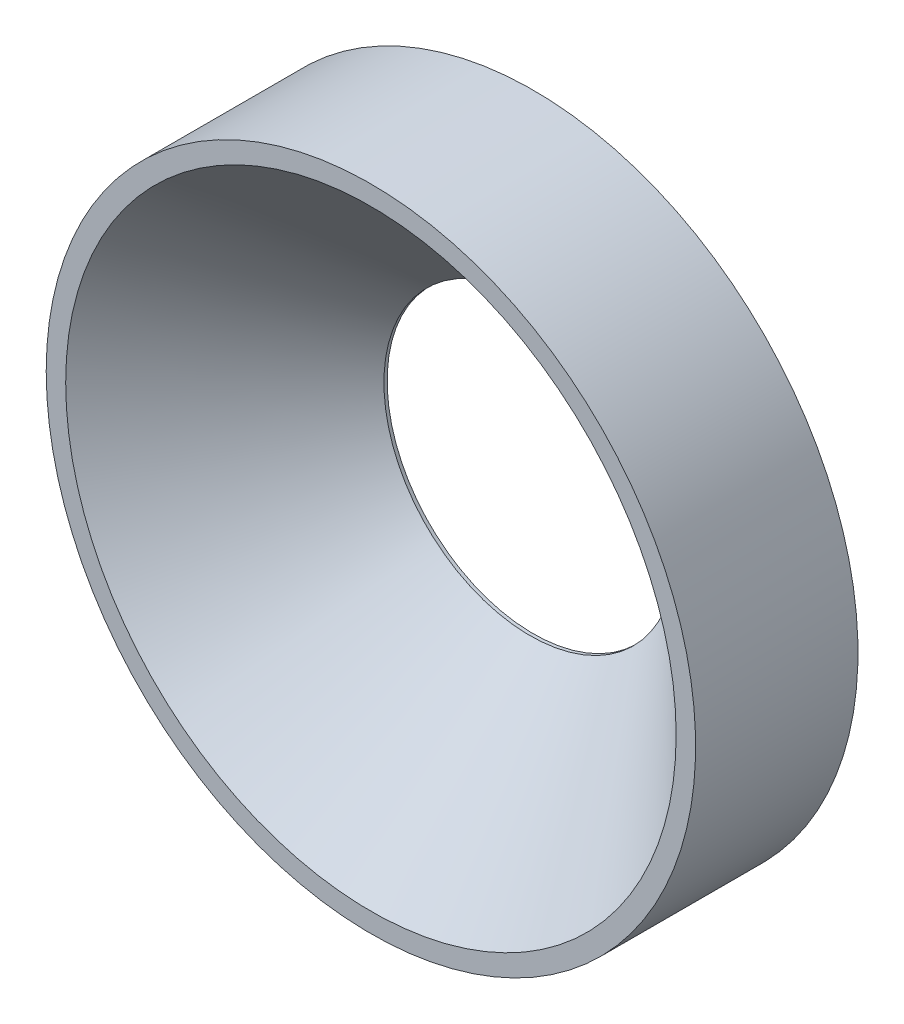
ISO-10303-21;
HEADER;
FILE_DESCRIPTION(('STEP AP214'),'2;1');
FILE_NAME('part.step','',(''),(''),'','','');
FILE_SCHEMA(('AUTOMOTIVE_DESIGN { 1 0 10303 214 1 1 1 1 }'));
ENDSEC;
DATA;
#1=APPLICATION_CONTEXT('core data for automotive mechanical design processes');
#2=APPLICATION_PROTOCOL_DEFINITION('international standard','automotive_design',2000,#1);
#3=PRODUCT_CONTEXT('',#1,'mechanical');
#4=PRODUCT('Part','Part','',(#3));
#5=PRODUCT_RELATED_PRODUCT_CATEGORY('part','',(#4));
#6=PRODUCT_DEFINITION_FORMATION('','',#4);
#7=PRODUCT_DEFINITION_CONTEXT('part definition',#1,'design');
#8=PRODUCT_DEFINITION('design','',#6,#7);
#9=PRODUCT_DEFINITION_SHAPE('','',#8);
#10=(LENGTH_UNIT() NAMED_UNIT(*) SI_UNIT(.MILLI.,.METRE.));
#11=(NAMED_UNIT(*) PLANE_ANGLE_UNIT() SI_UNIT($,.RADIAN.));
#12=(NAMED_UNIT(*) SI_UNIT($,.STERADIAN.) SOLID_ANGLE_UNIT());
#13=UNCERTAINTY_MEASURE_WITH_UNIT(LENGTH_MEASURE(1.E-05),#10,'distance_accuracy_value','');
#14=(GEOMETRIC_REPRESENTATION_CONTEXT(3) GLOBAL_UNCERTAINTY_ASSIGNED_CONTEXT((#13)) GLOBAL_UNIT_ASSIGNED_CONTEXT((#10,
#11,#12)) REPRESENTATION_CONTEXT('',''));
#15=CARTESIAN_POINT('',(0.,0.,0.));
#16=DIRECTION('',(0.,0.,1.));
#17=DIRECTION('',(1.,0.,0.));
#18=AXIS2_PLACEMENT_3D('',#15,#16,#17);
#19=CARTESIAN_POINT('',(0.,0.,2.5));
#20=DIRECTION('',(0.,0.,-1.));
#21=DIRECTION('',(-1.,0.,0.));
#22=AXIS2_PLACEMENT_3D('',#19,#20,#21);
#23=CYLINDRICAL_SURFACE('',#22,5.);
#24=CARTESIAN_POINT('',(0.,0.,2.5));
#25=DIRECTION('',(0.,0.,1.));
#26=DIRECTION('',(1.,0.,0.));
#27=AXIS2_PLACEMENT_3D('',#24,#25,#26);
#28=CIRCLE('',#27,5.);
#29=CARTESIAN_POINT('',(-5.00000000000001,0.,2.5));
#30=VERTEX_POINT('',#29);
#31=EDGE_CURVE('E10',#30,#30,#28,.T.);
#32=CARTESIAN_POINT('',(0.,0.,0.));
#33=DIRECTION('',(0.,0.,1.));
#34=DIRECTION('',(1.,0.,0.));
#35=AXIS2_PLACEMENT_3D('',#32,#33,#34);
#36=CIRCLE('',#35,5.);
#37=CARTESIAN_POINT('',(-5.00000000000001,0.,0.));
#38=VERTEX_POINT('',#37);
#39=EDGE_CURVE('E35',#38,#38,#36,.T.);
#40=CARTESIAN_POINT('',(-5.00000000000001,0.,2.5));
#41=CARTESIAN_POINT('',(-5.00000000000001,0.,2.47395833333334));
#42=CARTESIAN_POINT('',(-5.00000000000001,0.,2.44791666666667));
#43=CARTESIAN_POINT('',(-5.00000000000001,0.,2.39583333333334));
#44=CARTESIAN_POINT('',(-5.00000000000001,0.,2.36979166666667));
#45=CARTESIAN_POINT('',(-5.00000000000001,0.,2.31770833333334));
#46=CARTESIAN_POINT('',(-5.00000000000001,0.,2.29166666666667));
#47=CARTESIAN_POINT('',(-5.00000000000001,0.,2.23958333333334));
#48=CARTESIAN_POINT('',(-5.00000000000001,0.,2.21354166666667));
#49=CARTESIAN_POINT('',(-5.00000000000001,0.,2.16145833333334));
#50=CARTESIAN_POINT('',(-5.00000000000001,0.,2.13541666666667));
#51=CARTESIAN_POINT('',(-5.00000000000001,0.,2.08333333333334));
#52=CARTESIAN_POINT('',(-5.00000000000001,0.,2.05729166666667));
#53=CARTESIAN_POINT('',(-5.00000000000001,0.,2.00520833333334));
#54=CARTESIAN_POINT('',(-5.00000000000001,0.,1.97916666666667));
#55=CARTESIAN_POINT('',(-5.00000000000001,0.,1.92708333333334));
#56=CARTESIAN_POINT('',(-5.00000000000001,0.,1.90104166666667));
#57=CARTESIAN_POINT('',(-5.00000000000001,0.,1.84895833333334));
#58=CARTESIAN_POINT('',(-5.00000000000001,0.,1.82291666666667));
#59=CARTESIAN_POINT('',(-5.00000000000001,0.,1.77083333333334));
#60=CARTESIAN_POINT('',(-5.00000000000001,0.,1.74479166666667));
#61=CARTESIAN_POINT('',(-5.00000000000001,0.,1.69270833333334));
#62=CARTESIAN_POINT('',(-5.00000000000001,0.,1.66666666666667));
#63=CARTESIAN_POINT('',(-5.00000000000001,0.,1.61458333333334));
#64=CARTESIAN_POINT('',(-5.00000000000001,0.,1.58854166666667));
#65=CARTESIAN_POINT('',(-5.00000000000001,0.,1.53645833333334));
#66=CARTESIAN_POINT('',(-5.00000000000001,0.,1.51041666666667));
#67=CARTESIAN_POINT('',(-5.00000000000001,0.,1.45833333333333));
#68=CARTESIAN_POINT('',(-5.00000000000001,0.,1.43229166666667));
#69=CARTESIAN_POINT('',(-5.00000000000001,0.,1.38020833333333));
#70=CARTESIAN_POINT('',(-5.00000000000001,0.,1.35416666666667));
#71=CARTESIAN_POINT('',(-5.00000000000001,0.,1.30208333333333));
#72=CARTESIAN_POINT('',(-5.00000000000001,0.,1.27604166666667));
#73=CARTESIAN_POINT('',(-5.00000000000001,0.,1.22395833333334));
#74=CARTESIAN_POINT('',(-5.00000000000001,0.,1.19791666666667));
#75=CARTESIAN_POINT('',(-5.00000000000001,0.,1.14583333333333));
#76=CARTESIAN_POINT('',(-5.00000000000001,0.,1.11979166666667));
#77=CARTESIAN_POINT('',(-5.00000000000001,0.,1.06770833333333));
#78=CARTESIAN_POINT('',(-5.00000000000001,0.,1.04166666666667));
#79=CARTESIAN_POINT('',(-5.00000000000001,0.,0.989583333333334));
#80=CARTESIAN_POINT('',(-5.00000000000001,0.,0.963541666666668));
#81=CARTESIAN_POINT('',(-5.00000000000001,0.,0.911458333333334));
#82=CARTESIAN_POINT('',(-5.00000000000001,0.,0.885416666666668));
#83=CARTESIAN_POINT('',(-5.00000000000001,0.,0.833333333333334));
#84=CARTESIAN_POINT('',(-5.00000000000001,0.,0.807291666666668));
#85=CARTESIAN_POINT('',(-5.00000000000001,0.,0.755208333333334));
#86=CARTESIAN_POINT('',(-5.00000000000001,0.,0.729166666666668));
#87=CARTESIAN_POINT('',(-5.00000000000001,0.,0.677083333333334));
#88=CARTESIAN_POINT('',(-5.00000000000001,0.,0.651041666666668));
#89=CARTESIAN_POINT('',(-5.00000000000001,0.,0.598958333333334));
#90=CARTESIAN_POINT('',(-5.00000000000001,0.,0.572916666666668));
#91=CARTESIAN_POINT('',(-5.00000000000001,0.,0.520833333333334));
#92=CARTESIAN_POINT('',(-5.00000000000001,0.,0.494791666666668));
#93=CARTESIAN_POINT('',(-5.00000000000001,0.,0.442708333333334));
#94=CARTESIAN_POINT('',(-5.00000000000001,0.,0.416666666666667));
#95=CARTESIAN_POINT('',(-5.00000000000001,0.,0.364583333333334));
#96=CARTESIAN_POINT('',(-5.00000000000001,0.,0.338541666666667));
#97=CARTESIAN_POINT('',(-5.00000000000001,0.,0.286458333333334));
#98=CARTESIAN_POINT('',(-5.00000000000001,0.,0.260416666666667));
#99=CARTESIAN_POINT('',(-5.00000000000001,0.,0.208333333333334));
#100=CARTESIAN_POINT('',(-5.00000000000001,0.,0.182291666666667));
#101=CARTESIAN_POINT('',(-5.00000000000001,0.,0.130208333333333));
#102=CARTESIAN_POINT('',(-5.00000000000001,0.,0.104166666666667));
#103=CARTESIAN_POINT('',(-5.00000000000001,0.,0.0520833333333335));
#104=CARTESIAN_POINT('',(-5.00000000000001,0.,0.026041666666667));
#105=CARTESIAN_POINT('',(-5.00000000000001,0.,0.));
#106=B_SPLINE_CURVE_WITH_KNOTS('',3,(#40,#41,#42,#43,#44,#45,#46,#47,#48,#49,#50,#51,#52,#53,
#54,#55,#56,#57,#58,#59,#60,#61,#62,#63,#64,#65,#66,#67,#68,#69,#70,#71,#72,#73,#74,#75,#76,#77,
#78,#79,#80,#81,#82,#83,#84,#85,#86,#87,#88,#89,#90,#91,#92,#93,#94,#95,#96,#97,#98,#99,#100,
#101,#102,#103,#104,#105),.UNSPECIFIED.,.F.,.F.,(4,2,2,2,2,2,2,2,2,2,2,2,2,2,2,2,2,2,2,2,2,2,2,
2,2,2,2,2,2,2,2,2,4),(0.,0.0781250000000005,0.156250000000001,0.234375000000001,
0.312500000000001,0.390625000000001,0.468750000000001,0.546875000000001,0.625000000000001,
0.703125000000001,0.781250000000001,0.859375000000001,0.937500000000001,1.015625,1.09375,
1.171875,1.25,1.328125,1.40625,1.484375,1.5625,1.640625,1.71875,1.796875,1.875,1.953125,2.03125,
2.109375,2.1875,2.265625,2.34375,2.421875,2.5),.UNSPECIFIED.);
#107=EDGE_CURVE('BSEAM28',#30,#38,#106,.T.);
#108=ORIENTED_EDGE('',*,*,#31,.F.);
#109=ORIENTED_EDGE('',*,*,#39,.T.);
#110=ORIENTED_EDGE('',*,*,#107,.T.);
#111=ORIENTED_EDGE('',*,*,#107,.F.);
#112=EDGE_LOOP('',(#108,#110,#109,#111));
#113=FACE_BOUND('',#112,.T.);
#114=ADVANCED_FACE('F28',(#113),#23,.T.);
#115=CARTESIAN_POINT('',(0.,0.,2.5));
#116=DIRECTION('',(0.,0.,1.));
#117=DIRECTION('',(1.,0.,0.));
#118=AXIS2_PLACEMENT_3D('',#115,#116,#117);
#119=PLANE('',#118);
#120=CARTESIAN_POINT('',(0.,0.,2.5));
#121=DIRECTION('',(0.,0.,1.));
#122=DIRECTION('',(1.,0.,0.));
#123=AXIS2_PLACEMENT_3D('',#120,#121,#122);
#124=CIRCLE('',#123,4.7);
#125=CARTESIAN_POINT('',(4.70000000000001,0.,2.5));
#126=VERTEX_POINT('',#125);
#127=EDGE_CURVE('E41',#126,#126,#124,.T.);
#128=ORIENTED_EDGE('',*,*,#127,.F.);
#129=EDGE_LOOP('',(#128));
#130=FACE_BOUND('',#129,.T.);
#131=ORIENTED_EDGE('',*,*,#31,.T.);
#132=EDGE_LOOP('',(#131));
#133=FACE_BOUND('',#132,.T.);
#134=ADVANCED_FACE('F57',(#130,#133),#119,.T.);
#135=CARTESIAN_POINT('',(0.,0.,0.));
#136=DIRECTION('',(0.,0.,1.));
#137=DIRECTION('',(1.,0.,0.));
#138=AXIS2_PLACEMENT_3D('',#135,#136,#137);
#139=PLANE('',#138);
#140=CARTESIAN_POINT('',(0.,0.,0.));
#141=DIRECTION('',(0.,0.,1.));
#142=DIRECTION('',(1.,0.,0.));
#143=AXIS2_PLACEMENT_3D('',#140,#141,#142);
#144=CIRCLE('',#143,2.25);
#145=CARTESIAN_POINT('',(2.25000000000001,0.,0.));
#146=VERTEX_POINT('',#145);
#147=EDGE_CURVE('E31',#146,#146,#144,.T.);
#148=ORIENTED_EDGE('',*,*,#147,.T.);
#149=EDGE_LOOP('',(#148));
#150=FACE_BOUND('',#149,.T.);
#151=ORIENTED_EDGE('',*,*,#39,.F.);
#152=EDGE_LOOP('',(#151));
#153=FACE_BOUND('',#152,.T.);
#154=ADVANCED_FACE('F59',(#150,#153),#139,.F.);
#155=CARTESIAN_POINT('',(0.,0.,2.5));
#156=DIRECTION('',(0.,0.,1.));
#157=DIRECTION('',(1.,0.,0.));
#158=AXIS2_PLACEMENT_3D('',#155,#156,#157);
#159=CYLINDRICAL_SURFACE('',#158,2.25);
#160=CARTESIAN_POINT('',(0.,0.,0.0499999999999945));
#161=DIRECTION('',(0.,0.,1.));
#162=DIRECTION('',(1.,0.,0.));
#163=AXIS2_PLACEMENT_3D('',#160,#161,#162);
#164=CIRCLE('',#163,2.25);
#165=CARTESIAN_POINT('',(2.25000000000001,0.,0.0499999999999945));
#166=VERTEX_POINT('',#165);
#167=EDGE_CURVE('E44',#166,#166,#164,.T.);
#168=CARTESIAN_POINT('',(2.25000000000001,0.,0.0499999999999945));
#169=CARTESIAN_POINT('',(2.25000000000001,0.,0.0494791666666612));
#170=CARTESIAN_POINT('',(2.25000000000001,0.,0.0489583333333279));
#171=CARTESIAN_POINT('',(2.25000000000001,0.,0.0479166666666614));
#172=CARTESIAN_POINT('',(2.25000000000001,0.,0.0473958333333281));
#173=CARTESIAN_POINT('',(2.25000000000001,0.,0.0463541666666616));
#174=CARTESIAN_POINT('',(2.25000000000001,0.,0.0458333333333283));
#175=CARTESIAN_POINT('',(2.25000000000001,0.,0.0447916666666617));
#176=CARTESIAN_POINT('',(2.25000000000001,0.,0.0442708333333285));
#177=CARTESIAN_POINT('',(2.25000000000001,0.,0.0432291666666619));
#178=CARTESIAN_POINT('',(2.25000000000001,0.,0.0427083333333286));
#179=CARTESIAN_POINT('',(2.25000000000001,0.,0.0416666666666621));
#180=CARTESIAN_POINT('',(2.25000000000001,0.,0.0411458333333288));
#181=CARTESIAN_POINT('',(2.25000000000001,0.,0.0401041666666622));
#182=CARTESIAN_POINT('',(2.25000000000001,0.,0.039583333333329));
#183=CARTESIAN_POINT('',(2.25000000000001,0.,0.0385416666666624));
#184=CARTESIAN_POINT('',(2.25000000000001,0.,0.0380208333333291));
#185=CARTESIAN_POINT('',(2.25000000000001,0.,0.0369791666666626));
#186=CARTESIAN_POINT('',(2.25000000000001,0.,0.0364583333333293));
#187=CARTESIAN_POINT('',(2.25000000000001,0.,0.0354166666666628));
#188=CARTESIAN_POINT('',(2.25000000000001,0.,0.0348958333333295));
#189=CARTESIAN_POINT('',(2.25000000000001,0.,0.0338541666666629));
#190=CARTESIAN_POINT('',(2.25000000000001,0.,0.0333333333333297));
#191=CARTESIAN_POINT('',(2.25000000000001,0.,0.0322916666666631));
#192=CARTESIAN_POINT('',(2.25000000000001,0.,0.0317708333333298));
#193=CARTESIAN_POINT('',(2.25000000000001,0.,0.0307291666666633));
#194=CARTESIAN_POINT('',(2.25000000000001,0.,0.03020833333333));
#195=CARTESIAN_POINT('',(2.25000000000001,0.,0.0291666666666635));
#196=CARTESIAN_POINT('',(2.25000000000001,0.,0.0286458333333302));
#197=CARTESIAN_POINT('',(2.25000000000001,0.,0.0276041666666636));
#198=CARTESIAN_POINT('',(2.25000000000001,0.,0.0270833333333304));
#199=CARTESIAN_POINT('',(2.25000000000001,0.,0.0260416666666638));
#200=CARTESIAN_POINT('',(2.25000000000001,0.,0.0255208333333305));
#201=CARTESIAN_POINT('',(2.25000000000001,0.,0.024479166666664));
#202=CARTESIAN_POINT('',(2.25000000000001,0.,0.0239583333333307));
#203=CARTESIAN_POINT('',(2.25000000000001,0.,0.0229166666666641));
#204=CARTESIAN_POINT('',(2.25000000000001,0.,0.0223958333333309));
#205=CARTESIAN_POINT('',(2.25000000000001,0.,0.0213541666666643));
#206=CARTESIAN_POINT('',(2.25000000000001,0.,0.020833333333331));
#207=CARTESIAN_POINT('',(2.25000000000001,0.,0.0197916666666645));
#208=CARTESIAN_POINT('',(2.25000000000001,0.,0.0192708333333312));
#209=CARTESIAN_POINT('',(2.25000000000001,0.,0.0182291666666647));
#210=CARTESIAN_POINT('',(2.25000000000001,0.,0.0177083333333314));
#211=CARTESIAN_POINT('',(2.25000000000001,0.,0.0166666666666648));
#212=CARTESIAN_POINT('',(2.25000000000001,0.,0.0161458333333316));
#213=CARTESIAN_POINT('',(2.25000000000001,0.,0.015104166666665));
#214=CARTESIAN_POINT('',(2.25000000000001,0.,0.0145833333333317));
#215=CARTESIAN_POINT('',(2.25000000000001,0.,0.0135416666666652));
#216=CARTESIAN_POINT('',(2.25000000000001,0.,0.0130208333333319));
#217=CARTESIAN_POINT('',(2.25000000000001,0.,0.0119791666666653));
#218=CARTESIAN_POINT('',(2.25000000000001,0.,0.0114583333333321));
#219=CARTESIAN_POINT('',(2.25000000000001,0.,0.0104166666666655));
#220=CARTESIAN_POINT('',(2.25000000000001,0.,0.00989583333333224));
#221=CARTESIAN_POINT('',(2.25000000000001,0.,0.00885416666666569));
#222=CARTESIAN_POINT('',(2.25000000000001,0.,0.00833333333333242));
#223=CARTESIAN_POINT('',(2.25000000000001,0.,0.00729166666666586));
#224=CARTESIAN_POINT('',(2.25000000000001,0.,0.00677083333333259));
#225=CARTESIAN_POINT('',(2.25000000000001,0.,0.00572916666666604));
#226=CARTESIAN_POINT('',(2.25000000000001,0.,0.00520833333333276));
#227=CARTESIAN_POINT('',(2.25000000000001,0.,0.00416666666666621));
#228=CARTESIAN_POINT('',(2.25000000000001,0.,0.00364583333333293));
#229=CARTESIAN_POINT('',(2.25000000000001,0.,0.00260416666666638));
#230=CARTESIAN_POINT('',(2.25000000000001,0.,0.0020833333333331));
#231=CARTESIAN_POINT('',(2.25000000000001,0.,0.00104166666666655));
#232=CARTESIAN_POINT('',(2.25000000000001,0.,0.000520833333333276));
#233=CARTESIAN_POINT('',(2.25000000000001,0.,0.));
#234=B_SPLINE_CURVE_WITH_KNOTS('',3,(#168,#169,#170,#171,#172,#173,#174,#175,#176,#177,#178,
#179,#180,#181,#182,#183,#184,#185,#186,#187,#188,#189,#190,#191,#192,#193,#194,#195,#196,#197,
#198,#199,#200,#201,#202,#203,#204,#205,#206,#207,#208,#209,#210,#211,#212,#213,#214,#215,#216,
#217,#218,#219,#220,#221,#222,#223,#224,#225,#226,#227,#228,#229,#230,#231,#232,#233),
.UNSPECIFIED.,.F.,.F.,(4,2,2,2,2,2,2,2,2,2,2,2,2,2,2,2,2,2,2,2,2,2,2,2,2,2,2,2,2,2,2,2,4),(0.,
0.00156249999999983,0.00312499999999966,0.00468749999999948,0.00624999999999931,
0.00781249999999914,0.00937499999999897,0.0109374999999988,0.0124999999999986,
0.0140624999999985,0.0156249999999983,0.0171874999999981,0.0187499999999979,0.0203124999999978,
0.0218749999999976,0.0234374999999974,0.0249999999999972,0.0265624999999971,0.0281249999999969,
0.0296874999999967,0.0312499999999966,0.0328124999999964,0.0343749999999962,0.035937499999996,
0.0374999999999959,0.0390624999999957,0.0406249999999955,0.0421874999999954,0.0437499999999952,
0.045312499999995,0.0468749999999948,0.0484374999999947,0.0499999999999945),.UNSPECIFIED.);
#235=EDGE_CURVE('BSEAM48',#166,#146,#234,.T.);
#236=ORIENTED_EDGE('',*,*,#167,.T.);
#237=ORIENTED_EDGE('',*,*,#147,.F.);
#238=ORIENTED_EDGE('',*,*,#235,.T.);
#239=ORIENTED_EDGE('',*,*,#235,.F.);
#240=EDGE_LOOP('',(#236,#238,#237,#239));
#241=FACE_BOUND('',#240,.T.);
#242=ADVANCED_FACE('F48',(#241),#159,.F.);
#243=CARTESIAN_POINT('',(0.,0.,2.5));
#244=DIRECTION('',(0.,0.,1.));
#245=DIRECTION('',(1.,0.,0.));
#246=AXIS2_PLACEMENT_3D('',#243,#244,#245);
#247=CONICAL_SURFACE('',#246,4.7,0.785398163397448);
#248=CARTESIAN_POINT('',(2.25,0.,0.0499999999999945));
#249=CARTESIAN_POINT('',(2.27552083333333,0.,0.0755208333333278));
#250=CARTESIAN_POINT('',(2.30104166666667,0.,0.101041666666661));
#251=CARTESIAN_POINT('',(2.35208333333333,0.,0.152083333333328));
#252=CARTESIAN_POINT('',(2.37760416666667,0.,0.177604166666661));
#253=CARTESIAN_POINT('',(2.42864583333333,0.,0.228645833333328));
#254=CARTESIAN_POINT('',(2.45416666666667,0.,0.254166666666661));
#255=CARTESIAN_POINT('',(2.50520833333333,0.,0.305208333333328));
#256=CARTESIAN_POINT('',(2.53072916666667,0.,0.330729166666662));
#257=CARTESIAN_POINT('',(2.58177083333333,0.,0.381770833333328));
#258=CARTESIAN_POINT('',(2.60729166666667,0.,0.407291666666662));
#259=CARTESIAN_POINT('',(2.65833333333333,0.,0.458333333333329));
#260=CARTESIAN_POINT('',(2.68385416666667,0.,0.483854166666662));
#261=CARTESIAN_POINT('',(2.73489583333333,0.,0.534895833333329));
#262=CARTESIAN_POINT('',(2.76041666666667,0.,0.560416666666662));
#263=CARTESIAN_POINT('',(2.81145833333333,0.,0.611458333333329));
#264=CARTESIAN_POINT('',(2.83697916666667,0.,0.636979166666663));
#265=CARTESIAN_POINT('',(2.88802083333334,0.,0.688020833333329));
#266=CARTESIAN_POINT('',(2.91354166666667,0.,0.713541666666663));
#267=CARTESIAN_POINT('',(2.96458333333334,0.,0.76458333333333));
#268=CARTESIAN_POINT('',(2.99010416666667,0.,0.790104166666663));
#269=CARTESIAN_POINT('',(3.04114583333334,0.,0.84114583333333));
#270=CARTESIAN_POINT('',(3.06666666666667,0.,0.866666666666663));
#271=CARTESIAN_POINT('',(3.11770833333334,0.,0.91770833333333));
#272=CARTESIAN_POINT('',(3.14322916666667,0.,0.943229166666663));
#273=CARTESIAN_POINT('',(3.19427083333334,0.,0.99427083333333));
#274=CARTESIAN_POINT('',(3.21979166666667,0.,1.01979166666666));
#275=CARTESIAN_POINT('',(3.27083333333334,0.,1.07083333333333));
#276=CARTESIAN_POINT('',(3.29635416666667,0.,1.09635416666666));
#277=CARTESIAN_POINT('',(3.34739583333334,0.,1.14739583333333));
#278=CARTESIAN_POINT('',(3.37291666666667,0.,1.17291666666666));
#279=CARTESIAN_POINT('',(3.42395833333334,0.,1.22395833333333));
#280=CARTESIAN_POINT('',(3.44947916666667,0.,1.24947916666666));
#281=CARTESIAN_POINT('',(3.50052083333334,0.,1.30052083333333));
#282=CARTESIAN_POINT('',(3.52604166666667,0.,1.32604166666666));
#283=CARTESIAN_POINT('',(3.57708333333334,0.,1.37708333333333));
#284=CARTESIAN_POINT('',(3.60260416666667,0.,1.40260416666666));
#285=CARTESIAN_POINT('',(3.65364583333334,0.,1.45364583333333));
#286=CARTESIAN_POINT('',(3.67916666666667,0.,1.47916666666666));
#287=CARTESIAN_POINT('',(3.73020833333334,0.,1.53020833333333));
#288=CARTESIAN_POINT('',(3.75572916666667,0.,1.55572916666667));
#289=CARTESIAN_POINT('',(3.80677083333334,0.,1.60677083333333));
#290=CARTESIAN_POINT('',(3.83229166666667,0.,1.63229166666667));
#291=CARTESIAN_POINT('',(3.88333333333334,0.,1.68333333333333));
#292=CARTESIAN_POINT('',(3.90885416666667,0.,1.70885416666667));
#293=CARTESIAN_POINT('',(3.95989583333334,0.,1.75989583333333));
#294=CARTESIAN_POINT('',(3.98541666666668,0.,1.78541666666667));
#295=CARTESIAN_POINT('',(4.03645833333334,0.,1.83645833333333));
#296=CARTESIAN_POINT('',(4.06197916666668,0.,1.86197916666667));
#297=CARTESIAN_POINT('',(4.11302083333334,0.,1.91302083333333));
#298=CARTESIAN_POINT('',(4.13854166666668,0.,1.93854166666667));
#299=CARTESIAN_POINT('',(4.18958333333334,0.,1.98958333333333));
#300=CARTESIAN_POINT('',(4.21510416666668,0.,2.01510416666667));
#301=CARTESIAN_POINT('',(4.26614583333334,0.,2.06614583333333));
#302=CARTESIAN_POINT('',(4.29166666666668,0.,2.09166666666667));
#303=CARTESIAN_POINT('',(4.34270833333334,0.,2.14270833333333));
#304=CARTESIAN_POINT('',(4.36822916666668,0.,2.16822916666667));
#305=CARTESIAN_POINT('',(4.41927083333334,0.,2.21927083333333));
#306=CARTESIAN_POINT('',(4.44479166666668,0.,2.24479166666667));
#307=CARTESIAN_POINT('',(4.49583333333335,0.,2.29583333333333));
#308=CARTESIAN_POINT('',(4.52135416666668,0.,2.32135416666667));
#309=CARTESIAN_POINT('',(4.57239583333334,0.,2.37239583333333));
#310=CARTESIAN_POINT('',(4.59791666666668,0.,2.39791666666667));
#311=CARTESIAN_POINT('',(4.64895833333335,0.,2.44895833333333));
#312=CARTESIAN_POINT('',(4.67447916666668,0.,2.47447916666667));
#313=CARTESIAN_POINT('',(4.70000000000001,0.,2.5));
#314=B_SPLINE_CURVE_WITH_KNOTS('',3,(#248,#249,#250,#251,#252,#253,#254,#255,#256,#257,#258,
#259,#260,#261,#262,#263,#264,#265,#266,#267,#268,#269,#270,#271,#272,#273,#274,#275,#276,#277,
#278,#279,#280,#281,#282,#283,#284,#285,#286,#287,#288,#289,#290,#291,#292,#293,#294,#295,#296,
#297,#298,#299,#300,#301,#302,#303,#304,#305,#306,#307,#308,#309,#310,#311,#312,#313),
.UNSPECIFIED.,.F.,.F.,(4,2,2,2,2,2,2,2,2,2,2,2,2,2,2,2,2,2,2,2,2,2,2,2,2,2,2,2,2,2,2,2,4),(0.,
0.10827572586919,0.216551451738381,0.324827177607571,0.433102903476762,0.541378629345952,
0.649654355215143,0.757930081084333,0.866205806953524,0.974481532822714,1.0827572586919,
1.1910329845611,1.29930871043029,1.40758443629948,1.51586016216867,1.62413588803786,
1.73241161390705,1.84068733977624,1.94896306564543,2.05723879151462,2.16551451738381,
2.273790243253,2.38206596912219,2.49034169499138,2.59861742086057,2.70689314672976,
2.81516887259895,2.92344459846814,3.03172032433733,3.13999605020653,3.24827177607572,
3.35654750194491,3.4648232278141),.UNSPECIFIED.);
#315=EDGE_CURVE('BSEAM51',#166,#126,#314,.T.);
#316=ORIENTED_EDGE('',*,*,#167,.F.);
#317=ORIENTED_EDGE('',*,*,#127,.T.);
#318=ORIENTED_EDGE('',*,*,#315,.T.);
#319=ORIENTED_EDGE('',*,*,#315,.F.);
#320=EDGE_LOOP('',(#316,#318,#317,#319));
#321=FACE_BOUND('',#320,.T.);
#322=ADVANCED_FACE('F51',(#321),#247,.F.);
#323=CLOSED_SHELL('',(#114,#134,#154,#242,#322));
#324=MANIFOLD_SOLID_BREP('B2',#323);
#325=ADVANCED_BREP_SHAPE_REPRESENTATION('',(#18,#324),#14);
#326=SHAPE_DEFINITION_REPRESENTATION(#9,#325);
ENDSEC;
END-ISO-10303-21;
